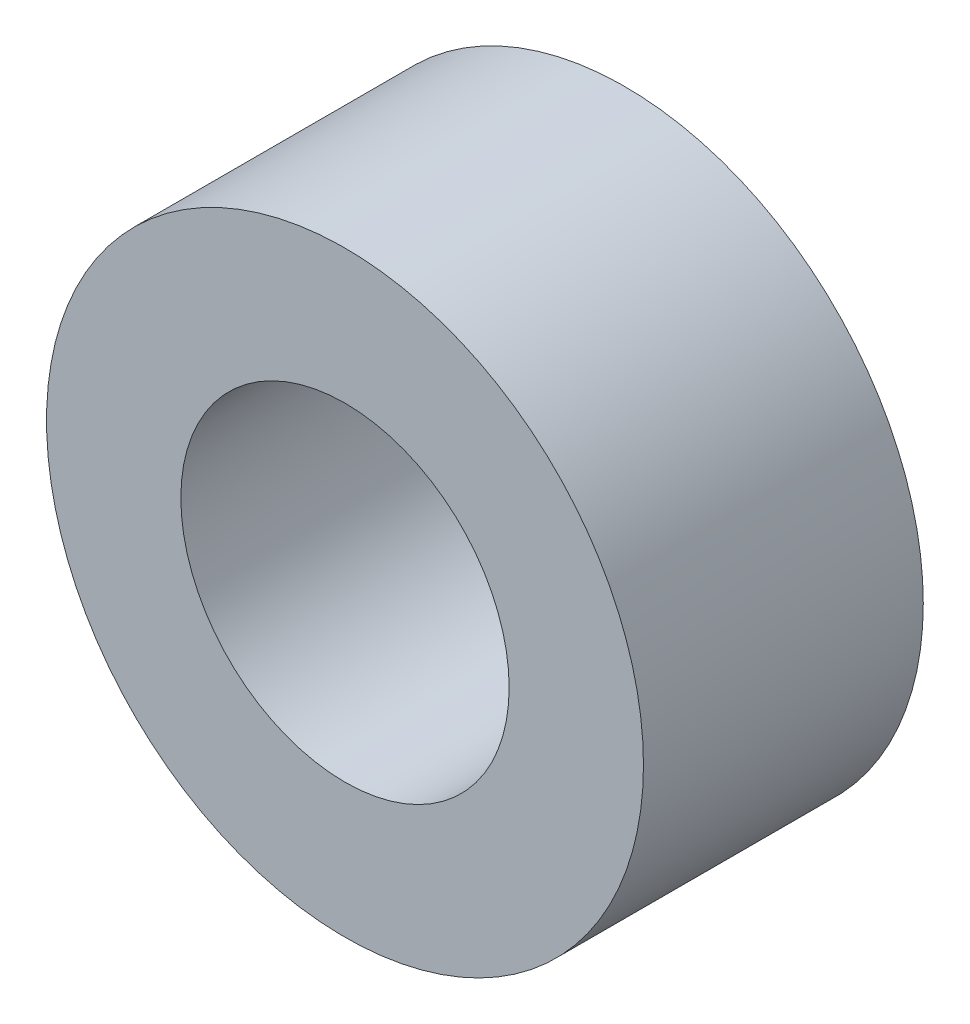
ISO-10303-21;
HEADER;
FILE_DESCRIPTION(('STEP AP214'),'2;1');
FILE_NAME('part.step','',(''),(''),'','','');
FILE_SCHEMA(('AUTOMOTIVE_DESIGN { 1 0 10303 214 1 1 1 1 }'));
ENDSEC;
DATA;
#1=APPLICATION_CONTEXT('core data for automotive mechanical design processes');
#2=APPLICATION_PROTOCOL_DEFINITION('international standard','automotive_design',2000,#1);
#3=PRODUCT_CONTEXT('',#1,'mechanical');
#4=PRODUCT('Part','Part','',(#3));
#5=PRODUCT_RELATED_PRODUCT_CATEGORY('part','',(#4));
#6=PRODUCT_DEFINITION_FORMATION('','',#4);
#7=PRODUCT_DEFINITION_CONTEXT('part definition',#1,'design');
#8=PRODUCT_DEFINITION('design','',#6,#7);
#9=PRODUCT_DEFINITION_SHAPE('','',#8);
#10=(LENGTH_UNIT() NAMED_UNIT(*) SI_UNIT(.MILLI.,.METRE.));
#11=(NAMED_UNIT(*) PLANE_ANGLE_UNIT() SI_UNIT($,.RADIAN.));
#12=(NAMED_UNIT(*) SI_UNIT($,.STERADIAN.) SOLID_ANGLE_UNIT());
#13=UNCERTAINTY_MEASURE_WITH_UNIT(LENGTH_MEASURE(1.E-05),#10,'distance_accuracy_value','');
#14=(GEOMETRIC_REPRESENTATION_CONTEXT(3) GLOBAL_UNCERTAINTY_ASSIGNED_CONTEXT((#13)) GLOBAL_UNIT_ASSIGNED_CONTEXT((#10,
#11,#12)) REPRESENTATION_CONTEXT('',''));
#15=CARTESIAN_POINT('',(0.,0.,0.));
#16=DIRECTION('',(0.,0.,1.));
#17=DIRECTION('',(1.,0.,0.));
#18=AXIS2_PLACEMENT_3D('',#15,#16,#17);
#19=CARTESIAN_POINT('',(0.,0.,7.5));
#20=DIRECTION('',(0.,0.,-1.));
#21=DIRECTION('',(-1.,0.,0.));
#22=AXIS2_PLACEMENT_3D('',#19,#20,#21);
#23=CYLINDRICAL_SURFACE('',#22,8.);
#24=CARTESIAN_POINT('',(0.,0.,7.5));
#25=DIRECTION('',(0.,0.,1.));
#26=DIRECTION('',(1.,0.,0.));
#27=AXIS2_PLACEMENT_3D('',#24,#25,#26);
#28=CIRCLE('',#27,8.);
#29=CARTESIAN_POINT('',(8.,0.,7.5));
#30=VERTEX_POINT('',#29);
#31=EDGE_CURVE('E10',#30,#30,#28,.T.);
#32=ORIENTED_EDGE('',*,*,#31,.F.);
#33=EDGE_LOOP('',(#32));
#34=FACE_BOUND('',#33,.T.);
#35=CARTESIAN_POINT('',(0.,0.,0.));
#36=DIRECTION('',(0.,0.,1.));
#37=DIRECTION('',(1.,0.,0.));
#38=AXIS2_PLACEMENT_3D('',#35,#36,#37);
#39=CIRCLE('',#38,8.);
#40=CARTESIAN_POINT('',(8.,0.,0.));
#41=VERTEX_POINT('',#40);
#42=EDGE_CURVE('E48',#41,#41,#39,.T.);
#43=ORIENTED_EDGE('',*,*,#42,.T.);
#44=EDGE_LOOP('',(#43));
#45=FACE_BOUND('',#44,.T.);
#46=ADVANCED_FACE('F45',(#34,#45),#23,.T.);
#47=CARTESIAN_POINT('',(0.,0.,7.5));
#48=DIRECTION('',(0.,0.,1.));
#49=DIRECTION('',(1.,0.,0.));
#50=AXIS2_PLACEMENT_3D('',#47,#48,#49);
#51=PLANE('',#50);
#52=CARTESIAN_POINT('',(0.,0.,7.5));
#53=DIRECTION('',(0.,0.,1.));
#54=DIRECTION('',(1.,0.,0.));
#55=AXIS2_PLACEMENT_3D('',#52,#53,#54);
#56=CIRCLE('',#55,4.39999999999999);
#57=CARTESIAN_POINT('',(4.39999999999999,0.,7.5));
#58=VERTEX_POINT('',#57);
#59=EDGE_CURVE('E62',#58,#58,#56,.T.);
#60=ORIENTED_EDGE('',*,*,#59,.F.);
#61=EDGE_LOOP('',(#60));
#62=FACE_BOUND('',#61,.T.);
#63=ORIENTED_EDGE('',*,*,#31,.T.);
#64=EDGE_LOOP('',(#63));
#65=FACE_BOUND('',#64,.T.);
#66=ADVANCED_FACE('F69',(#62,#65),#51,.T.);
#67=CARTESIAN_POINT('',(0.,0.,0.));
#68=DIRECTION('',(0.,0.,1.));
#69=DIRECTION('',(1.,0.,0.));
#70=AXIS2_PLACEMENT_3D('',#67,#68,#69);
#71=PLANE('',#70);
#72=CARTESIAN_POINT('',(0.,0.,0.));
#73=DIRECTION('',(0.,0.,1.));
#74=DIRECTION('',(1.,0.,0.));
#75=AXIS2_PLACEMENT_3D('',#72,#73,#74);
#76=CIRCLE('',#75,4.39999999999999);
#77=CARTESIAN_POINT('',(4.39999999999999,0.,0.));
#78=VERTEX_POINT('',#77);
#79=EDGE_CURVE('E57',#78,#78,#76,.T.);
#80=ORIENTED_EDGE('',*,*,#79,.T.);
#81=EDGE_LOOP('',(#80));
#82=FACE_BOUND('',#81,.T.);
#83=ORIENTED_EDGE('',*,*,#42,.F.);
#84=EDGE_LOOP('',(#83));
#85=FACE_BOUND('',#84,.T.);
#86=ADVANCED_FACE('F71',(#82,#85),#71,.F.);
#87=CARTESIAN_POINT('',(0.,0.,7.5));
#88=DIRECTION('',(0.,0.,1.));
#89=DIRECTION('',(1.,0.,0.));
#90=AXIS2_PLACEMENT_3D('',#87,#88,#89);
#91=CYLINDRICAL_SURFACE('',#90,4.39999999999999);
#92=ORIENTED_EDGE('',*,*,#79,.F.);
#93=EDGE_LOOP('',(#92));
#94=FACE_BOUND('',#93,.T.);
#95=ORIENTED_EDGE('',*,*,#59,.T.);
#96=EDGE_LOOP('',(#95));
#97=FACE_BOUND('',#96,.T.);
#98=ADVANCED_FACE('F67',(#94,#97),#91,.F.);
#99=CLOSED_SHELL('',(#46,#66,#86,#98));
#100=MANIFOLD_SOLID_BREP('B2',#99);
#101=ADVANCED_BREP_SHAPE_REPRESENTATION('',(#18,#100),#14);
#102=SHAPE_DEFINITION_REPRESENTATION(#9,#101);
ENDSEC;
END-ISO-10303-21;
